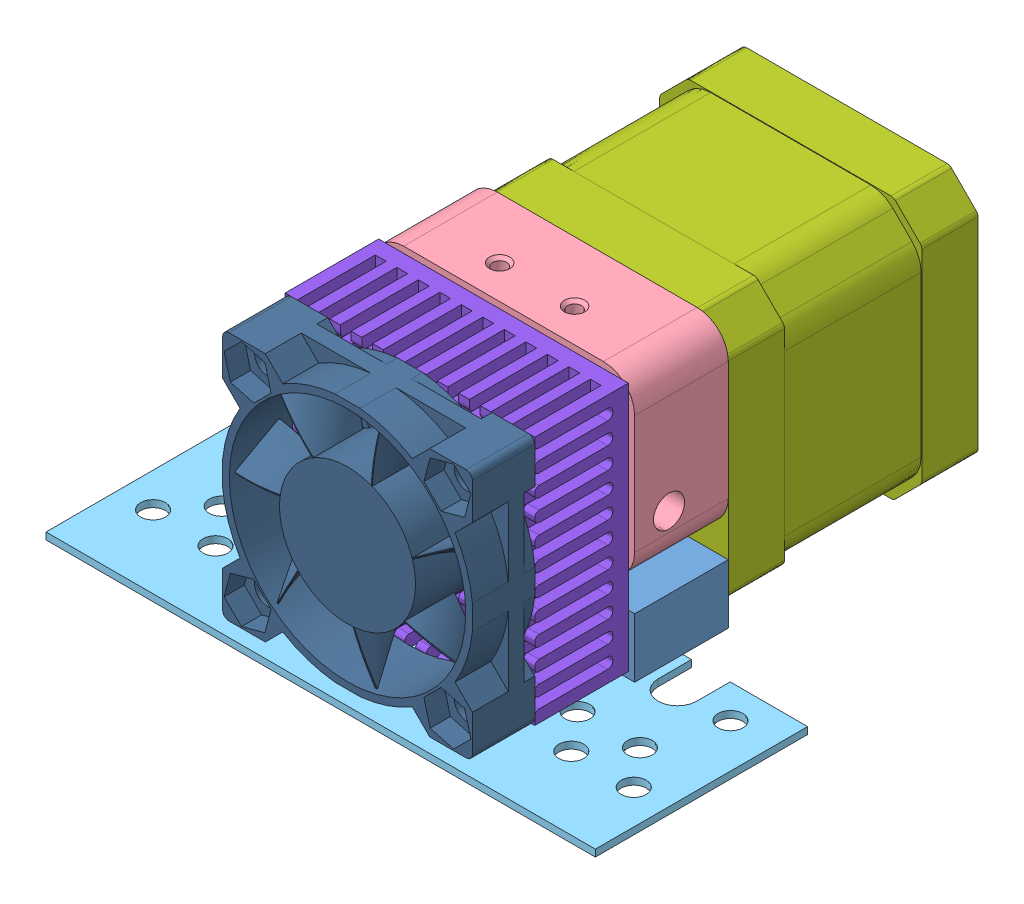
SolidWorks assembly Assembly.SLDASM, configuration Default (file format 5000). Lengths in mm.
Overall size (88 68.75 80.19).
10 component instances, 10 part files, 27 mates.
Components (placement in the parent):
- MBE Chassis Block-1: MBE Chassis Block.SLDPRT [Default] at (-4.1508 -3.0708 2.1494) size (42 9.5 15)
- MBE Heater Block-2: MBE Heater Block.SLDPRT [Default] at (-14.1508 -21.8208 4.2994) x (-1 0 0) z (0 0 -1) size (19 10 19)
- MBE Nozzle .35mm-2: MBE Nozzle .35mm.SLDPRT [Default] at (-10.1508 -16.8208 4.2994) x (-0.866025 0 -0.5) z (-0.5 0 0.866025) size (8.89 13 7)
- MBE Filament Drive Block-1: MBE Filament Drive Block.SLDPRT [Default] at (-4.1508 24.4292 -5.3506) size (42 29 15)
- MBE Universal Mount-1: MBE Universal Mount.SLDPRT [Default] at (-10.1508 -7.1808 15.9494) x (-1 0 0) z (0 0 -1) size (88 1.11 34)
- MBE Filament Barrel-1: MBE Filament Barrel.SLDPRT [Default] at (-10.1508 -16.8208 4.2994) x (-0.971919 0 -0.235317) z (0.235317 0 -0.971919) size (6 26.5 6)
- NEMA17 Stepper Motor-1: NEMA17 Stepper Motor.SLDPRT [Default] at (-4.1508 17.9292 -45.3506) x (1 0 0) z (0 -1 0) size (42 63 42)
- MBE Heatsink 40x40x15-1: MBE Heatsink 40x40x15.SLDPRT [Default] at (-42.1008 11.9792 4.3044) x (0 -1 0) z (1 0 0) size (40 15 40)
- Raptor Drive Gear-1: Raptor Drive Gear.SLDPRT [Default] at (13.3989 -16.3054 4.1494) x (0.950144 0.311811 0) z (-0.311811 0.950144 0) size (11.67 11 11.66)
- Fan-1: Fan.SLDPRT [Default] at (-6.0572 17.6662 27.7816) x (1 0 0) z (0 1 0) size (40 10.19 40)
Mates (geometry in assembly coordinates):
- Coincident2: coincident anti-aligned: plane of MBE Heater Block-2 through (-14.1508 -21.8208 4.2994) normal (0 -1 0); plane of MBE Nozzle .35mm-2 through (-10.1508 -21.8208 4.2994) normal (0 1 0)
- Concentric1: concentric aligned: cylinder of MBE Heater Block-2 through (-10.1508 -21.8208 4.2994) axis (0 1 0) radius 2.5; cylinder of MBE Nozzle .35mm-2 through (-10.1508 -21.8208 4.2994) axis (0 1 0) radius 3
- Coincident6: coincident aligned: plane of MBE Chassis Block-1 through (16.8492 6.4292 9.6494) normal (0 0 1); plane of MBE Filament Drive Block-1 through (-4.1508 24.4292 9.6494) normal (0 0 1)
- Coincident7: coincident aligned: plane of MBE Chassis Block-1 through (16.8492 6.4292 9.6494) normal (1 0 0); plane of MBE Filament Drive Block-1 through (16.8492 9.9292 9.6494) normal (1 0 0)
- Coincident10: coincident anti-aligned: plane of MBE Nozzle .35mm-2 through (-10.1508 -16.8208 4.2994) normal (0 1 0); plane of MBE Filament Barrel-1 through (-10.1508 -16.8208 4.2994) normal (0 -1 0)
- Concentric3: concentric anti-aligned: cylinder of MBE Heater Block-2 through (-10.1508 -21.8208 4.2994) axis (0 1 0) radius 2.5; cylinder of MBE Filament Barrel-1 through (-10.1508 9.6792 4.2994) axis (0 -1 0) radius 3
- Parallel6: parallel aligned: plane of MBE Chassis Block-1 through (-4.1508 6.4292 2.1494) normal (0 1 0); plane of MBE Heater Block-2 through (-14.1508 -11.8208 4.2994) normal (0 1 0)
- Concentric4: concentric anti-aligned: cylinder of MBE Chassis Block-1 through (-10.1508 -3.0708 4.2994) axis (0 1 0) radius 2.5; cylinder of MBE Filament Barrel-1 through (-10.1508 9.6792 4.2994) axis (0 -1 0) radius 3
- Parallel7: parallel anti-aligned: plane of MBE Chassis Block-1 through (16.8492 6.4292 9.6494) normal (0 0 1); plane of MBE Heater Block-2 through (-23.6508 -11.8208 -5.2006) normal (0 0 -1)
- Parallel8: parallel anti-aligned: plane of MBE Chassis Block-1 through (-4.1508 6.4292 2.1494) normal (0 1 0); plane of MBE Universal Mount-1 through (-10.1508 -6.6808 15.9494) normal (0 -1 0)
- Parallel9: parallel aligned: plane of MBE Chassis Block-1 through (16.8492 6.4292 9.6494) normal (0 0 1); plane of MBE Universal Mount-1 through (-54.1508 -5.5708 32.9494) normal (0 0 1)
- Concentric5: concentric anti-aligned: cylinder of MBE Universal Mount-1 through (-10.1508 -6.6808 4.2994) axis (0 1 0) radius 3.1; cylinder of MBE Filament Barrel-1 through (-10.1508 9.6792 4.2994) axis (0 -1 0) radius 3
- Distance1: distance = 42 mm anti-aligned: plane of MBE Filament Drive Block-1 through (16.8492 38.9292 9.6494) normal (0 1 0); plane of MBE Chassis Block-1 through (-4.1508 -3.0708 2.1494) normal (0 -1 0)
- Coincident25: coincident anti-aligned: plane of MBE Chassis Block-1 through (16.8492 6.4292 -5.3506) normal (0 0 -1); plane of NEMA17 Stepper Motor-1 through (-4.1508 17.9292 -5.3506) normal (0 0 1)
- Coincident26: coincident aligned: plane of MBE Chassis Block-1 through (16.8492 6.4292 9.6494) normal (1 0 0); plane of NEMA17 Stepper Motor-1 through (16.8492 1.4526 -5.3506) normal (1 0 0)
- Coincident27: coincident aligned: plane of MBE Chassis Block-1 through (-4.1508 -3.0708 2.1494) normal (0 -1 0); plane of NEMA17 Stepper Motor-1 through (12.3258 -3.0708 -5.3506) normal (0 -1 0)
- Coincident28: coincident anti-aligned: plane of MBE Chassis Block-1 through (16.8492 6.4292 9.6494) normal (0 0 1); plane of MBE Heatsink 40x40x15-1 through (-24.1508 17.9292 9.6494) normal (0 0 -1)
- Parallel10: parallel aligned: plane of MBE Chassis Block-1 through (16.8492 6.4292 9.6494) normal (1 0 0); plane of MBE Heatsink 40x40x15-1 through (15.8492 17.9626 17.4021) normal (1 0 0)
- Distance7: distance = 1 mm aligned: plane of MBE Heatsink 40x40x15-1 through (15.8492 17.9626 17.4021) normal (1 0 0); plane of MBE Chassis Block-1 through (16.8492 6.4292 9.6494) normal (1 0 0)
- Distance8: distance = 1 mm aligned: plane of MBE Heatsink 40x40x15-1 through (-24.1508 -2.0708 17.1494) normal (0 -1 0); plane of MBE Chassis Block-1 through (-4.1508 -3.0708 2.1494) normal (0 -1 0)
- Coincident32: coincident anti-aligned: plane of NEMA17 Stepper Motor-1 through (-4.1508 17.9292 -3.3506) normal (0 0 1); plane of Raptor Drive Gear-1 through (40.0007 -116.6084 -3.3506) normal (0 0 -1)
- Concentric6: concentric anti-aligned: cylinder of NEMA17 Stepper Motor-1 through (-4.1508 17.9292 17.6494) axis (0 0 -1) radius 2.5; cylinder of Raptor Drive Gear-1 through (-4.1508 17.9292 7.6494) axis (0 0 1) radius 2.5
- Coincident33: coincident anti-aligned: plane of MBE Heatsink 40x40x15-1 through (-24.1508 23.1457 24.6494) normal (0 0 1); plane of Fan-1 through (-4.1508 17.9292 24.6494) normal (0 0 -1)
- Distance9: distance = 1 mm aligned: plane of Fan-1 through (15.8492 -2.0708 28.8994) normal (1 0 0); plane of MBE Chassis Block-1 through (16.8492 6.4292 9.6494) normal (1 0 0)
- Distance10: distance = 1 mm aligned: plane of Fan-1 through (-24.1508 -2.0708 28.8994) normal (0 -1 0); plane of MBE Chassis Block-1 through (-4.1508 -3.0708 2.1494) normal (0 -1 0)
- Distance11: distance = 68.75 mm anti-aligned: plane of MBE Nozzle .35mm-2 through (-10.1508 -29.8208 4.2994) normal (0 -1 0); plane of MBE Filament Drive Block-1 through (16.8492 38.9292 9.6494) normal (0 1 0)
- Distance12: distance = 3 mm anti-aligned: plane of MBE Universal Mount-1 through (-10.1508 -6.0708 15.9494) normal (0 1 0); plane of MBE Chassis Block-1 through (-4.1508 -3.0708 2.1494) normal (0 -1 0)
